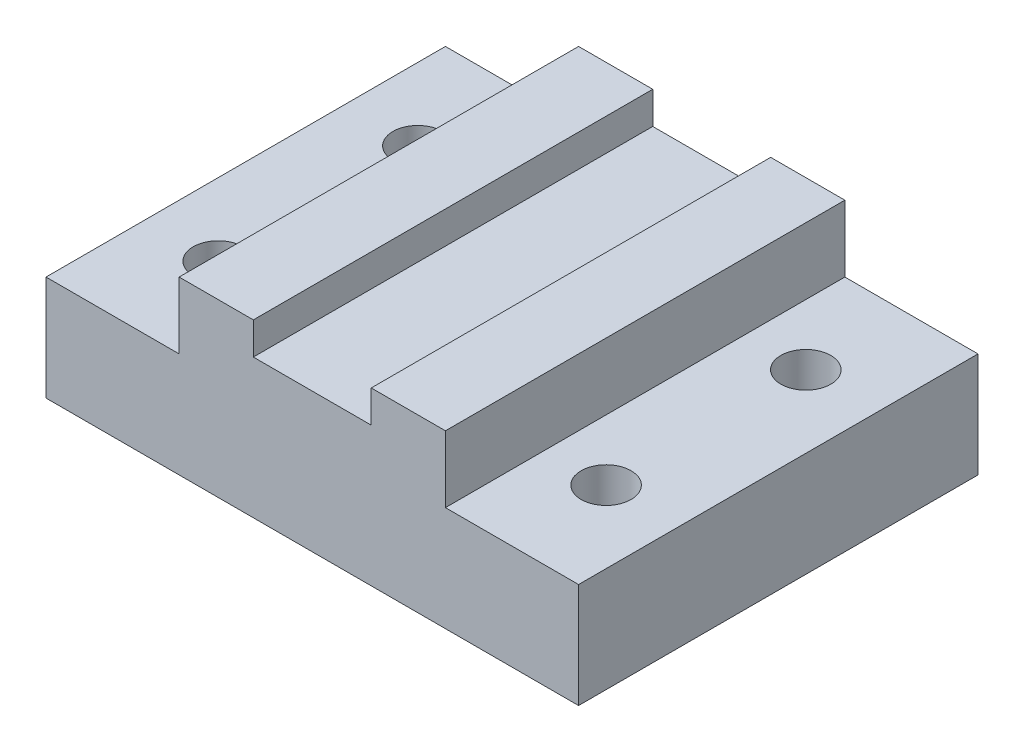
from build123d import *

# Parameters (mm, degrees)
SKETCH1_W          = 203.2
SKETCH1_H          = 40
EXTRUDE1_DEPTH     = 76.2
SKETCH3_W          = 101.6
SKETCH3_H          = 152.4
EXTRUDE2_DEPTH     = 25.4
SKETCH4_R          = 9.525
CUT_EXTRUDE1_DEPTH = 134.150291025
SKETCH5_W          = 44.98894096
SKETCH5_H          = 12.288338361
CUT_EXTRUDE2_DEPTH = 195.487737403


with BuildPart() as part:
    # Sketch1 → Extrude1 (new, symmetric)
    with BuildSketch(Plane.XY):
        with Locations((0, 20)):
            Rectangle(SKETCH1_W, SKETCH1_H)
    extrude(amount=EXTRUDE1_DEPTH, both=True)

    # Sketch3 → Extrude2 (add)
    with BuildSketch(Plane(origin=(0, 40, 0), x_dir=(-1, 0, 0), z_dir=(0, 1, 0))):
        Rectangle(SKETCH3_W, SKETCH3_H)
    extrude(amount=EXTRUDE2_DEPTH)

    # Sketch4 → Cut-Extrude1 (cut, through all)
    with BuildSketch(Plane(origin=(0, 40, 0), x_dir=(-1, 0, 0), z_dir=(0, 1, 0))):
        with Locations((74.00678882, 38.1)):
            Circle(SKETCH4_R)
        with Locations((74.00678882, -38.1)):
            Circle(SKETCH4_R)
        with Locations(Location((-74.00678882, -38.1, 0), (0, 0, 180))):
            Circle(SKETCH4_R)
        with Locations(Location((-74.00678882, 38.1, 0), (0, 0, 180))):
            Circle(SKETCH4_R)
    extrude(amount=-CUT_EXTRUDE1_DEPTH, mode=Mode.SUBTRACT)

    # Sketch5 → Cut-Extrude2 (cut, through all)
    with BuildSketch(Plane(origin=(0, 0, -76.2), x_dir=(-1, 0, 0), z_dir=(0, 0, -1))):
        with Locations((0, 59.25583082)):
            Rectangle(SKETCH5_W, SKETCH5_H)
    extrude(amount=-CUT_EXTRUDE2_DEPTH, mode=Mode.SUBTRACT)


solid = part.part
